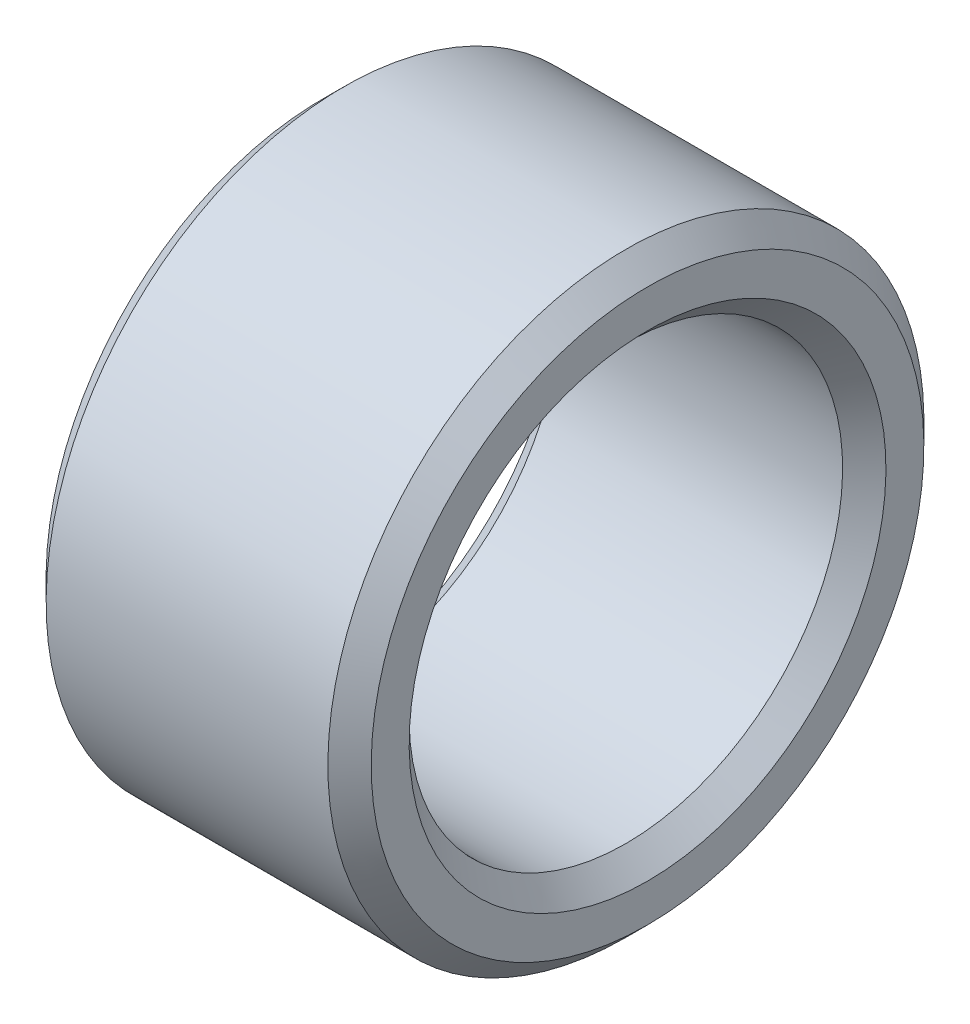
ISO-10303-21;
HEADER;
FILE_DESCRIPTION(('STEP AP214'),'2;1');
FILE_NAME('part.step','',(''),(''),'','','');
FILE_SCHEMA(('AUTOMOTIVE_DESIGN { 1 0 10303 214 1 1 1 1 }'));
ENDSEC;
DATA;
#1=APPLICATION_CONTEXT('core data for automotive mechanical design processes');
#2=APPLICATION_PROTOCOL_DEFINITION('international standard','automotive_design',2000,#1);
#3=PRODUCT_CONTEXT('',#1,'mechanical');
#4=PRODUCT('Part','Part','',(#3));
#5=PRODUCT_RELATED_PRODUCT_CATEGORY('part','',(#4));
#6=PRODUCT_DEFINITION_FORMATION('','',#4);
#7=PRODUCT_DEFINITION_CONTEXT('part definition',#1,'design');
#8=PRODUCT_DEFINITION('design','',#6,#7);
#9=PRODUCT_DEFINITION_SHAPE('','',#8);
#10=(LENGTH_UNIT() NAMED_UNIT(*) SI_UNIT(.MILLI.,.METRE.));
#11=(NAMED_UNIT(*) PLANE_ANGLE_UNIT() SI_UNIT($,.RADIAN.));
#12=(NAMED_UNIT(*) SI_UNIT($,.STERADIAN.) SOLID_ANGLE_UNIT());
#13=UNCERTAINTY_MEASURE_WITH_UNIT(LENGTH_MEASURE(1.E-05),#10,'distance_accuracy_value','');
#14=(GEOMETRIC_REPRESENTATION_CONTEXT(3) GLOBAL_UNCERTAINTY_ASSIGNED_CONTEXT((#13)) GLOBAL_UNIT_ASSIGNED_CONTEXT((#10,
#11,#12)) REPRESENTATION_CONTEXT('',''));
#15=CARTESIAN_POINT('',(0.,0.,0.));
#16=DIRECTION('',(0.,0.,1.));
#17=DIRECTION('',(1.,0.,0.));
#18=AXIS2_PLACEMENT_3D('',#15,#16,#17);
#19=CARTESIAN_POINT('',(0.,-4.75,0.));
#20=DIRECTION('',(-1.,0.,0.));
#21=DIRECTION('',(0.,1.,0.));
#22=AXIS2_PLACEMENT_3D('',#19,#20,#21);
#23=PLANE('',#22);
#24=CARTESIAN_POINT('',(0.,0.,0.));
#25=DIRECTION('',(1.,0.,0.));
#26=DIRECTION('',(0.,-1.,0.));
#27=AXIS2_PLACEMENT_3D('',#24,#25,#26);
#28=CIRCLE('',#27,4.4);
#29=CARTESIAN_POINT('',(0.,-4.4,0.));
#30=VERTEX_POINT('',#29);
#31=EDGE_CURVE('E9',#30,#30,#28,.T.);
#32=ORIENTED_EDGE('',*,*,#31,.T.);
#33=EDGE_LOOP('',(#32));
#34=FACE_BOUND('',#33,.T.);
#35=CARTESIAN_POINT('',(0.,0.,0.));
#36=DIRECTION('',(1.,0.,0.));
#37=DIRECTION('',(0.,-1.,0.));
#38=AXIS2_PLACEMENT_3D('',#35,#36,#37);
#39=CIRCLE('',#38,5.1);
#40=CARTESIAN_POINT('',(0.,-5.1,0.));
#41=VERTEX_POINT('',#40);
#42=EDGE_CURVE('E53',#41,#41,#39,.T.);
#43=ORIENTED_EDGE('',*,*,#42,.F.);
#44=EDGE_LOOP('',(#43));
#45=FACE_BOUND('',#44,.T.);
#46=ADVANCED_FACE('F15',(#34,#45),#23,.T.);
#47=CARTESIAN_POINT('',(0.2,0.,0.));
#48=DIRECTION('',(-1.,0.,0.));
#49=DIRECTION('',(0.,-1.,0.));
#50=AXIS2_PLACEMENT_3D('',#47,#48,#49);
#51=CONICAL_SURFACE('',#50,4.2,0.785398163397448);
#52=CARTESIAN_POINT('',(0.4,0.,0.));
#53=DIRECTION('',(1.,0.,0.));
#54=DIRECTION('',(0.,-1.,0.));
#55=AXIS2_PLACEMENT_3D('',#52,#53,#54);
#56=CIRCLE('',#55,4.);
#57=CARTESIAN_POINT('',(0.4,-4.,0.));
#58=VERTEX_POINT('',#57);
#59=EDGE_CURVE('E22',#58,#58,#56,.T.);
#60=ORIENTED_EDGE('',*,*,#59,.T.);
#61=EDGE_LOOP('',(#60));
#62=FACE_BOUND('',#61,.T.);
#63=ORIENTED_EDGE('',*,*,#31,.F.);
#64=EDGE_LOOP('',(#63));
#65=FACE_BOUND('',#64,.T.);
#66=ADVANCED_FACE('F82',(#62,#65),#51,.F.);
#67=CARTESIAN_POINT('',(3.,0.,0.));
#68=DIRECTION('',(-1.,0.,0.));
#69=DIRECTION('',(0.,-1.,0.));
#70=AXIS2_PLACEMENT_3D('',#67,#68,#69);
#71=CYLINDRICAL_SURFACE('',#70,4.);
#72=CARTESIAN_POINT('',(5.6,0.,0.));
#73=DIRECTION('',(1.,0.,0.));
#74=DIRECTION('',(0.,-1.,0.));
#75=AXIS2_PLACEMENT_3D('',#72,#73,#74);
#76=CIRCLE('',#75,4.);
#77=CARTESIAN_POINT('',(5.6,-4.,0.));
#78=VERTEX_POINT('',#77);
#79=EDGE_CURVE('E58',#78,#78,#76,.T.);
#80=ORIENTED_EDGE('',*,*,#79,.T.);
#81=EDGE_LOOP('',(#80));
#82=FACE_BOUND('',#81,.T.);
#83=ORIENTED_EDGE('',*,*,#59,.F.);
#84=EDGE_LOOP('',(#83));
#85=FACE_BOUND('',#84,.T.);
#86=ADVANCED_FACE('F66',(#82,#85),#71,.F.);
#87=CARTESIAN_POINT('',(5.8,0.,0.));
#88=DIRECTION('',(1.,0.,0.));
#89=DIRECTION('',(0.,-1.,0.));
#90=AXIS2_PLACEMENT_3D('',#87,#88,#89);
#91=CONICAL_SURFACE('',#90,4.2,0.78539816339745);
#92=CARTESIAN_POINT('',(6.,0.,0.));
#93=DIRECTION('',(1.,0.,0.));
#94=DIRECTION('',(0.,-1.,0.));
#95=AXIS2_PLACEMENT_3D('',#92,#93,#94);
#96=CIRCLE('',#95,4.4);
#97=CARTESIAN_POINT('',(6.,-4.4,0.));
#98=VERTEX_POINT('',#97);
#99=EDGE_CURVE('E63',#98,#98,#96,.T.);
#100=ORIENTED_EDGE('',*,*,#99,.T.);
#101=EDGE_LOOP('',(#100));
#102=FACE_BOUND('',#101,.T.);
#103=ORIENTED_EDGE('',*,*,#79,.F.);
#104=EDGE_LOOP('',(#103));
#105=FACE_BOUND('',#104,.T.);
#106=ADVANCED_FACE('F69',(#102,#105),#91,.F.);
#107=CARTESIAN_POINT('',(6.,-4.75,0.));
#108=DIRECTION('',(1.,0.,0.));
#109=DIRECTION('',(0.,-1.,0.));
#110=AXIS2_PLACEMENT_3D('',#107,#108,#109);
#111=PLANE('',#110);
#112=CARTESIAN_POINT('',(6.,0.,0.));
#113=DIRECTION('',(1.,0.,0.));
#114=DIRECTION('',(0.,-1.,0.));
#115=AXIS2_PLACEMENT_3D('',#112,#113,#114);
#116=CIRCLE('',#115,5.1);
#117=CARTESIAN_POINT('',(6.,-5.1,0.));
#118=VERTEX_POINT('',#117);
#119=EDGE_CURVE('E61',#118,#118,#116,.T.);
#120=ORIENTED_EDGE('',*,*,#119,.T.);
#121=EDGE_LOOP('',(#120));
#122=FACE_BOUND('',#121,.T.);
#123=ORIENTED_EDGE('',*,*,#99,.F.);
#124=EDGE_LOOP('',(#123));
#125=FACE_BOUND('',#124,.T.);
#126=ADVANCED_FACE('F71',(#122,#125),#111,.T.);
#127=CARTESIAN_POINT('',(5.8,0.,0.));
#128=DIRECTION('',(-1.,0.,0.));
#129=DIRECTION('',(0.,-1.,0.));
#130=AXIS2_PLACEMENT_3D('',#127,#128,#129);
#131=CONICAL_SURFACE('',#130,5.3,0.785398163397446);
#132=CARTESIAN_POINT('',(5.6,0.,0.));
#133=DIRECTION('',(1.,0.,0.));
#134=DIRECTION('',(0.,-1.,0.));
#135=AXIS2_PLACEMENT_3D('',#132,#133,#134);
#136=CIRCLE('',#135,5.5);
#137=CARTESIAN_POINT('',(5.6,-5.5,0.));
#138=VERTEX_POINT('',#137);
#139=EDGE_CURVE('E55',#138,#138,#136,.T.);
#140=ORIENTED_EDGE('',*,*,#139,.T.);
#141=EDGE_LOOP('',(#140));
#142=FACE_BOUND('',#141,.T.);
#143=ORIENTED_EDGE('',*,*,#119,.F.);
#144=EDGE_LOOP('',(#143));
#145=FACE_BOUND('',#144,.T.);
#146=ADVANCED_FACE('F79',(#142,#145),#131,.T.);
#147=CARTESIAN_POINT('',(3.,0.,0.));
#148=DIRECTION('',(-1.,0.,0.));
#149=DIRECTION('',(0.,-1.,0.));
#150=AXIS2_PLACEMENT_3D('',#147,#148,#149);
#151=CYLINDRICAL_SURFACE('',#150,5.5);
#152=CARTESIAN_POINT('',(0.4,0.,0.));
#153=DIRECTION('',(1.,0.,0.));
#154=DIRECTION('',(0.,-1.,0.));
#155=AXIS2_PLACEMENT_3D('',#152,#153,#154);
#156=CIRCLE('',#155,5.5);
#157=CARTESIAN_POINT('',(0.4,-5.5,0.));
#158=VERTEX_POINT('',#157);
#159=EDGE_CURVE('E49',#158,#158,#156,.T.);
#160=ORIENTED_EDGE('',*,*,#159,.T.);
#161=EDGE_LOOP('',(#160));
#162=FACE_BOUND('',#161,.T.);
#163=ORIENTED_EDGE('',*,*,#139,.F.);
#164=EDGE_LOOP('',(#163));
#165=FACE_BOUND('',#164,.T.);
#166=ADVANCED_FACE('F50',(#162,#165),#151,.T.);
#167=CARTESIAN_POINT('',(0.2,0.,0.));
#168=DIRECTION('',(1.,0.,0.));
#169=DIRECTION('',(0.,-1.,0.));
#170=AXIS2_PLACEMENT_3D('',#167,#168,#169);
#171=CONICAL_SURFACE('',#170,5.3,0.785398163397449);
#172=ORIENTED_EDGE('',*,*,#42,.T.);
#173=EDGE_LOOP('',(#172));
#174=FACE_BOUND('',#173,.T.);
#175=ORIENTED_EDGE('',*,*,#159,.F.);
#176=EDGE_LOOP('',(#175));
#177=FACE_BOUND('',#176,.T.);
#178=ADVANCED_FACE('F92',(#174,#177),#171,.T.);
#179=CLOSED_SHELL('',(#46,#66,#86,#106,#126,#146,#166,#178));
#180=MANIFOLD_SOLID_BREP('B1',#179);
#181=ADVANCED_BREP_SHAPE_REPRESENTATION('',(#18,#180),#14);
#182=SHAPE_DEFINITION_REPRESENTATION(#9,#181);
ENDSEC;
END-ISO-10303-21;
